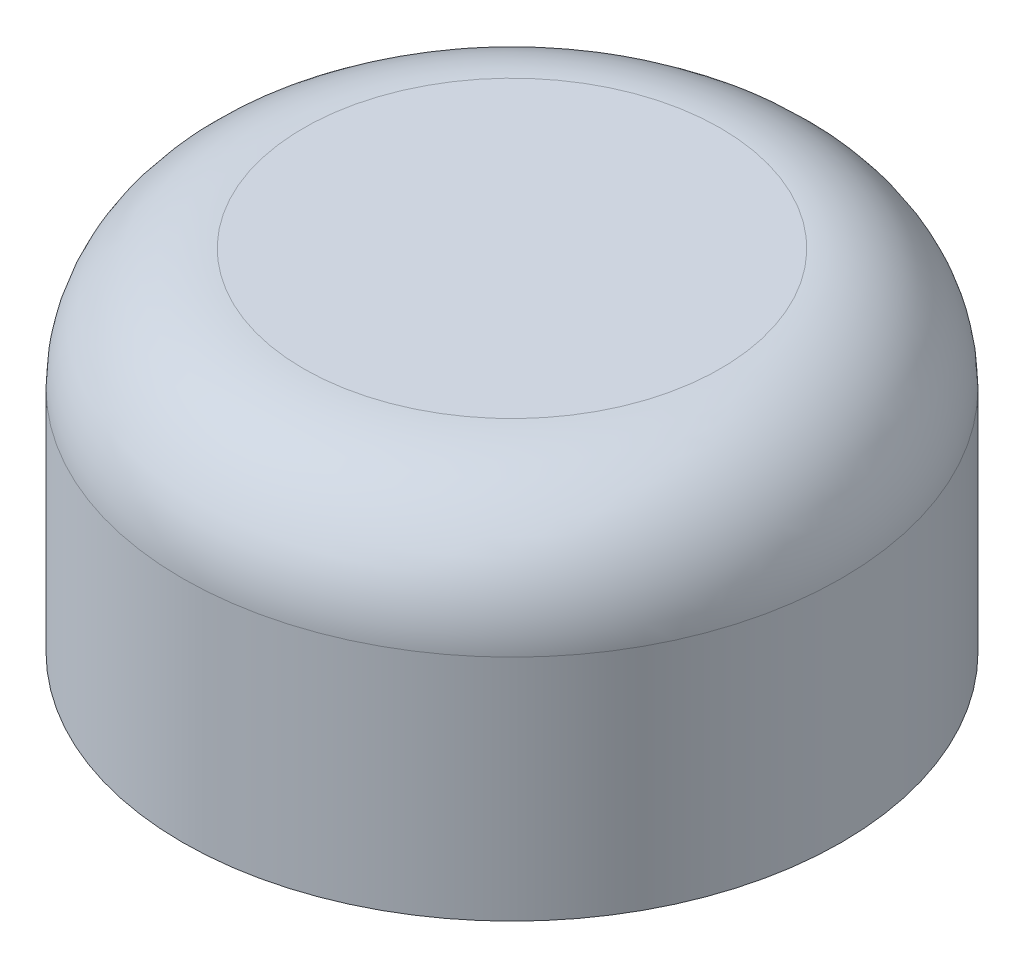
from build123d import *

# Parameters (mm, degrees)
FILLET1_R = 3.81
FILLET2_R = 4.572


with BuildPart() as part:
    # Sketch1 → Base-Revolve (revolve)
    with BuildSketch(Plane.XY, mode=Mode.PRIVATE) as base_revolve_sk:
        Polygon((0, 22.698261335), (12.446, 22.698261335), (12.446, 9.490261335), (10.16, 9.490261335), (10.16, 10.760261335), (11.684, 10.760261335), (11.684, 21.428261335), (0, 21.428261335), align=None)
    revolve(base_revolve_sk.sketch.rotate(Axis((0, 0, 0), (0, 1, 0)), 90), axis=Axis((0, 0, 0), (0, 1, 0)))

    # Fillet1
    fillet1_edges = [part.edges().sort_by_distance(p)[0] for p in [
        (0, 21.428261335, 11.684),
    ]]
    fillet(fillet1_edges, radius=FILLET1_R)

    # Fillet2
    fillet2_edges = [part.edges().sort_by_distance(p)[0] for p in [
        (0, 22.698261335, 12.446),
    ]]
    fillet(fillet2_edges, radius=FILLET2_R)


solid = part.part
